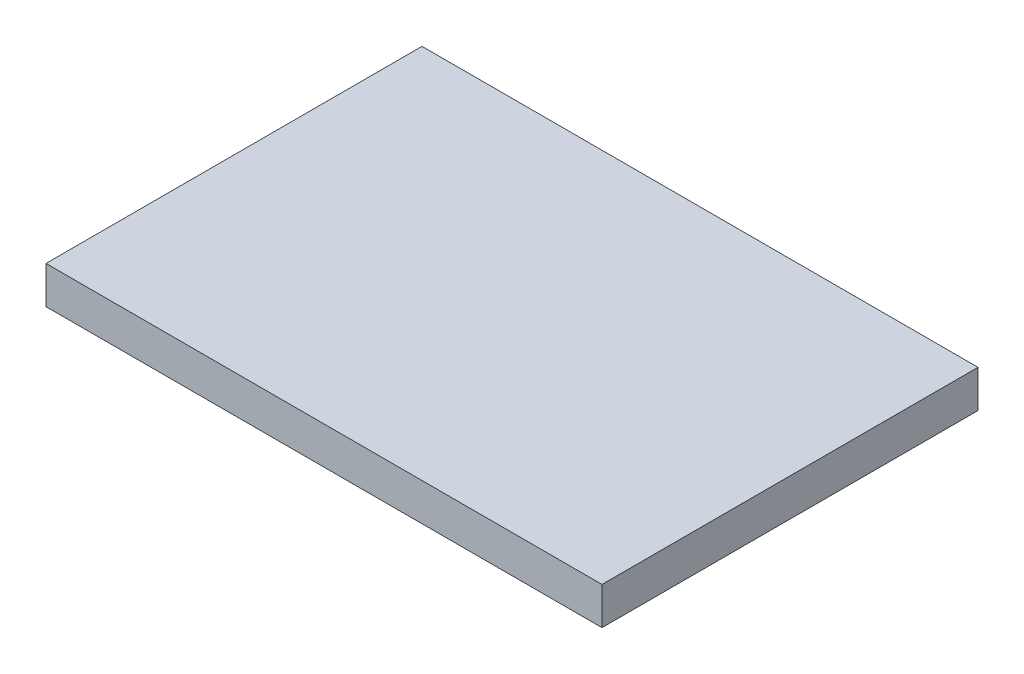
ISO-10303-21;
HEADER;
FILE_DESCRIPTION(('STEP AP214'),'2;1');
FILE_NAME('part.step','',(''),(''),'','','');
FILE_SCHEMA(('AUTOMOTIVE_DESIGN { 1 0 10303 214 1 1 1 1 }'));
ENDSEC;
DATA;
#1=APPLICATION_CONTEXT('core data for automotive mechanical design processes');
#2=APPLICATION_PROTOCOL_DEFINITION('international standard','automotive_design',2000,#1);
#3=PRODUCT_CONTEXT('',#1,'mechanical');
#4=PRODUCT('Part','Part','',(#3));
#5=PRODUCT_RELATED_PRODUCT_CATEGORY('part','',(#4));
#6=PRODUCT_DEFINITION_FORMATION('','',#4);
#7=PRODUCT_DEFINITION_CONTEXT('part definition',#1,'design');
#8=PRODUCT_DEFINITION('design','',#6,#7);
#9=PRODUCT_DEFINITION_SHAPE('','',#8);
#10=(LENGTH_UNIT() NAMED_UNIT(*) SI_UNIT(.MILLI.,.METRE.));
#11=(NAMED_UNIT(*) PLANE_ANGLE_UNIT() SI_UNIT($,.RADIAN.));
#12=(NAMED_UNIT(*) SI_UNIT($,.STERADIAN.) SOLID_ANGLE_UNIT());
#13=UNCERTAINTY_MEASURE_WITH_UNIT(LENGTH_MEASURE(1.E-05),#10,'distance_accuracy_value','');
#14=(GEOMETRIC_REPRESENTATION_CONTEXT(3) GLOBAL_UNCERTAINTY_ASSIGNED_CONTEXT((#13)) GLOBAL_UNIT_ASSIGNED_CONTEXT((#10,
#11,#12)) REPRESENTATION_CONTEXT('',''));
#15=CARTESIAN_POINT('',(0.,0.,0.));
#16=DIRECTION('',(0.,0.,1.));
#17=DIRECTION('',(1.,0.,0.));
#18=AXIS2_PLACEMENT_3D('',#15,#16,#17);
#19=CARTESIAN_POINT('',(114.470337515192,14.8141805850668,-74.1902678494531));
#20=DIRECTION('',(0.,0.,1.));
#21=DIRECTION('',(1.,0.,0.));
#22=AXIS2_PLACEMENT_3D('',#19,#20,#21);
#23=PLANE('',#22);
#24=DIRECTION('',(-1.,0.,0.));
#25=VECTOR('',#24,1.);
#26=CARTESIAN_POINT('',(114.470337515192,0.,-74.1902678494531));
#27=LINE('',#26,#25);
#28=CARTESIAN_POINT('',(114.470337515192,0.,-74.1902678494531));
#29=VERTEX_POINT('',#28);
#30=CARTESIAN_POINT('',(-105.477577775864,0.,-74.1902678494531));
#31=VERTEX_POINT('',#30);
#32=EDGE_CURVE('E70',#29,#31,#27,.T.);
#33=ORIENTED_EDGE('',*,*,#32,.T.);
#34=DIRECTION('',(0.,-1.,0.));
#35=VECTOR('',#34,1.);
#36=CARTESIAN_POINT('',(-105.477577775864,14.8141805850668,-74.1902678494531));
#37=LINE('',#36,#35);
#38=CARTESIAN_POINT('',(-105.477577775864,14.8141805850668,-74.1902678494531));
#39=VERTEX_POINT('',#38);
#40=EDGE_CURVE('E11',#39,#31,#37,.T.);
#41=ORIENTED_EDGE('',*,*,#40,.F.);
#42=DIRECTION('',(-1.,0.,0.));
#43=VECTOR('',#42,1.);
#44=CARTESIAN_POINT('',(114.470337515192,14.8141805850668,-74.1902678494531));
#45=LINE('',#44,#43);
#46=CARTESIAN_POINT('',(114.470337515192,14.8141805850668,-74.1902678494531));
#47=VERTEX_POINT('',#46);
#48=EDGE_CURVE('E88',#47,#39,#45,.T.);
#49=ORIENTED_EDGE('',*,*,#48,.F.);
#50=DIRECTION('',(0.,-1.,0.));
#51=VECTOR('',#50,1.);
#52=CARTESIAN_POINT('',(114.470337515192,14.8141805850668,-74.1902678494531));
#53=LINE('',#52,#51);
#54=EDGE_CURVE('E82',#47,#29,#53,.T.);
#55=ORIENTED_EDGE('',*,*,#54,.T.);
#56=EDGE_LOOP('',(#33,#41,#49,#55));
#57=FACE_BOUND('',#56,.T.);
#58=ADVANCED_FACE('F26',(#57),#23,.F.);
#59=CARTESIAN_POINT('',(-105.477577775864,14.8141805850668,-74.1902678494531));
#60=DIRECTION('',(1.,0.,0.));
#61=DIRECTION('',(0.,0.,-1.));
#62=AXIS2_PLACEMENT_3D('',#59,#60,#61);
#63=PLANE('',#62);
#64=DIRECTION('',(0.,0.,1.));
#65=VECTOR('',#64,1.);
#66=CARTESIAN_POINT('',(-105.477577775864,0.,-74.1902678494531));
#67=LINE('',#66,#65);
#68=CARTESIAN_POINT('',(-105.477577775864,0.,74.5649661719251));
#69=VERTEX_POINT('',#68);
#70=EDGE_CURVE('E66',#31,#69,#67,.T.);
#71=ORIENTED_EDGE('',*,*,#70,.T.);
#72=DIRECTION('',(0.,-1.,0.));
#73=VECTOR('',#72,1.);
#74=CARTESIAN_POINT('',(-105.477577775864,14.8141805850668,74.5649661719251));
#75=LINE('',#74,#73);
#76=CARTESIAN_POINT('',(-105.477577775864,14.8141805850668,74.5649661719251));
#77=VERTEX_POINT('',#76);
#78=EDGE_CURVE('E33',#77,#69,#75,.T.);
#79=ORIENTED_EDGE('',*,*,#78,.F.);
#80=DIRECTION('',(0.,0.,1.));
#81=VECTOR('',#80,1.);
#82=CARTESIAN_POINT('',(-105.477577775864,14.8141805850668,-74.1902678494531));
#83=LINE('',#82,#81);
#84=EDGE_CURVE('E78',#39,#77,#83,.T.);
#85=ORIENTED_EDGE('',*,*,#84,.F.);
#86=ORIENTED_EDGE('',*,*,#40,.T.);
#87=EDGE_LOOP('',(#71,#79,#85,#86));
#88=FACE_BOUND('',#87,.T.);
#89=ADVANCED_FACE('F77',(#88),#63,.F.);
#90=CARTESIAN_POINT('',(-105.477577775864,14.8141805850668,74.5649661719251));
#91=DIRECTION('',(0.,0.,-1.));
#92=DIRECTION('',(-1.,0.,0.));
#93=AXIS2_PLACEMENT_3D('',#90,#91,#92);
#94=PLANE('',#93);
#95=DIRECTION('',(1.,0.,0.));
#96=VECTOR('',#95,1.);
#97=CARTESIAN_POINT('',(-105.477577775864,0.,74.5649661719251));
#98=LINE('',#97,#96);
#99=CARTESIAN_POINT('',(114.470337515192,0.,74.5649661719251));
#100=VERTEX_POINT('',#99);
#101=EDGE_CURVE('E71',#69,#100,#98,.T.);
#102=ORIENTED_EDGE('',*,*,#101,.T.);
#103=DIRECTION('',(0.,-1.,0.));
#104=VECTOR('',#103,1.);
#105=CARTESIAN_POINT('',(114.470337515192,14.8141805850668,74.5649661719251));
#106=LINE('',#105,#104);
#107=CARTESIAN_POINT('',(114.470337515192,14.8141805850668,74.5649661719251));
#108=VERTEX_POINT('',#107);
#109=EDGE_CURVE('E94',#108,#100,#106,.T.);
#110=ORIENTED_EDGE('',*,*,#109,.F.);
#111=DIRECTION('',(1.,0.,0.));
#112=VECTOR('',#111,1.);
#113=CARTESIAN_POINT('',(-105.477577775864,14.8141805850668,74.5649661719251));
#114=LINE('',#113,#112);
#115=EDGE_CURVE('E45',#77,#108,#114,.T.);
#116=ORIENTED_EDGE('',*,*,#115,.F.);
#117=ORIENTED_EDGE('',*,*,#78,.T.);
#118=EDGE_LOOP('',(#102,#110,#116,#117));
#119=FACE_BOUND('',#118,.T.);
#120=ADVANCED_FACE('F97',(#119),#94,.F.);
#121=CARTESIAN_POINT('',(114.470337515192,14.8141805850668,74.5649661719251));
#122=DIRECTION('',(-1.,0.,0.));
#123=DIRECTION('',(0.,0.,1.));
#124=AXIS2_PLACEMENT_3D('',#121,#122,#123);
#125=PLANE('',#124);
#126=DIRECTION('',(0.,0.,-1.));
#127=VECTOR('',#126,1.);
#128=CARTESIAN_POINT('',(114.470337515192,0.,74.5649661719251));
#129=LINE('',#128,#127);
#130=EDGE_CURVE('E86',#100,#29,#129,.T.);
#131=ORIENTED_EDGE('',*,*,#130,.T.);
#132=ORIENTED_EDGE('',*,*,#54,.F.);
#133=DIRECTION('',(0.,0.,-1.));
#134=VECTOR('',#133,1.);
#135=CARTESIAN_POINT('',(114.470337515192,14.8141805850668,74.5649661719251));
#136=LINE('',#135,#134);
#137=EDGE_CURVE('E40',#108,#47,#136,.T.);
#138=ORIENTED_EDGE('',*,*,#137,.F.);
#139=ORIENTED_EDGE('',*,*,#109,.T.);
#140=EDGE_LOOP('',(#131,#132,#138,#139));
#141=FACE_BOUND('',#140,.T.);
#142=ADVANCED_FACE('F99',(#141),#125,.F.);
#143=CARTESIAN_POINT('',(-105.477577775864,14.8141805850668,-74.1902678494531));
#144=DIRECTION('',(0.,1.,0.));
#145=DIRECTION('',(0.,0.,1.));
#146=AXIS2_PLACEMENT_3D('',#143,#144,#145);
#147=PLANE('',#146);
#148=ORIENTED_EDGE('',*,*,#48,.T.);
#149=ORIENTED_EDGE('',*,*,#84,.T.);
#150=ORIENTED_EDGE('',*,*,#115,.T.);
#151=ORIENTED_EDGE('',*,*,#137,.T.);
#152=EDGE_LOOP('',(#148,#149,#150,#151));
#153=FACE_BOUND('',#152,.T.);
#154=ADVANCED_FACE('F100',(#153),#147,.T.);
#155=CARTESIAN_POINT('',(-105.477577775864,0.,-74.1902678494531));
#156=DIRECTION('',(0.,1.,0.));
#157=DIRECTION('',(0.,0.,1.));
#158=AXIS2_PLACEMENT_3D('',#155,#156,#157);
#159=PLANE('',#158);
#160=ORIENTED_EDGE('',*,*,#32,.F.);
#161=ORIENTED_EDGE('',*,*,#130,.F.);
#162=ORIENTED_EDGE('',*,*,#101,.F.);
#163=ORIENTED_EDGE('',*,*,#70,.F.);
#164=EDGE_LOOP('',(#160,#161,#162,#163));
#165=FACE_BOUND('',#164,.T.);
#166=ADVANCED_FACE('F67',(#165),#159,.F.);
#167=CLOSED_SHELL('',(#58,#89,#120,#142,#154,#166));
#168=MANIFOLD_SOLID_BREP('B2',#167);
#169=ADVANCED_BREP_SHAPE_REPRESENTATION('',(#18,#168),#14);
#170=SHAPE_DEFINITION_REPRESENTATION(#9,#169);
ENDSEC;
END-ISO-10303-21;
